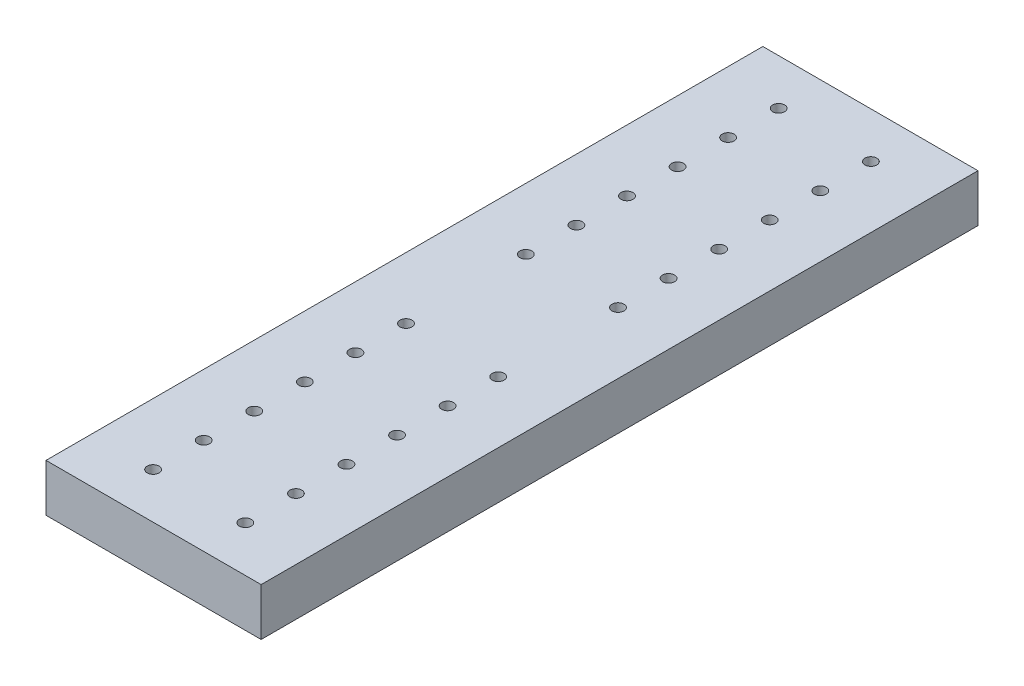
ISO-10303-21;
HEADER;
FILE_DESCRIPTION(('STEP AP214'),'2;1');
FILE_NAME('part.step','',(''),(''),'','','');
FILE_SCHEMA(('AUTOMOTIVE_DESIGN { 1 0 10303 214 1 1 1 1 }'));
ENDSEC;
DATA;
#1=APPLICATION_CONTEXT('core data for automotive mechanical design processes');
#2=APPLICATION_PROTOCOL_DEFINITION('international standard','automotive_design',2000,#1);
#3=PRODUCT_CONTEXT('',#1,'mechanical');
#4=PRODUCT('Part','Part','',(#3));
#5=PRODUCT_RELATED_PRODUCT_CATEGORY('part','',(#4));
#6=PRODUCT_DEFINITION_FORMATION('','',#4);
#7=PRODUCT_DEFINITION_CONTEXT('part definition',#1,'design');
#8=PRODUCT_DEFINITION('design','',#6,#7);
#9=PRODUCT_DEFINITION_SHAPE('','',#8);
#10=(LENGTH_UNIT() NAMED_UNIT(*) SI_UNIT(.MILLI.,.METRE.));
#11=(NAMED_UNIT(*) PLANE_ANGLE_UNIT() SI_UNIT($,.RADIAN.));
#12=(NAMED_UNIT(*) SI_UNIT($,.STERADIAN.) SOLID_ANGLE_UNIT());
#13=UNCERTAINTY_MEASURE_WITH_UNIT(LENGTH_MEASURE(1.E-05),#10,'distance_accuracy_value','');
#14=(GEOMETRIC_REPRESENTATION_CONTEXT(3) GLOBAL_UNCERTAINTY_ASSIGNED_CONTEXT((#13)) GLOBAL_UNIT_ASSIGNED_CONTEXT((#10,
#11,#12)) REPRESENTATION_CONTEXT('',''));
#15=CARTESIAN_POINT('',(0.,0.,0.));
#16=DIRECTION('',(0.,0.,1.));
#17=DIRECTION('',(1.,0.,0.));
#18=AXIS2_PLACEMENT_3D('',#15,#16,#17);
#19=CARTESIAN_POINT('',(-574.294,254.,1913.525));
#20=DIRECTION('',(1.,0.,0.));
#21=DIRECTION('',(0.,0.,-1.));
#22=AXIS2_PLACEMENT_3D('',#19,#20,#21);
#23=PLANE('',#22);
#24=DIRECTION('',(0.,0.,1.));
#25=VECTOR('',#24,1.);
#26=CARTESIAN_POINT('',(-574.294,0.,1913.525));
#27=LINE('',#26,#25);
#28=CARTESIAN_POINT('',(-574.294,0.,-1913.525));
#29=VERTEX_POINT('',#28);
#30=CARTESIAN_POINT('',(-574.294,0.,1913.525));
#31=VERTEX_POINT('',#30);
#32=EDGE_CURVE('E111',#29,#31,#27,.T.);
#33=ORIENTED_EDGE('',*,*,#32,.T.);
#34=DIRECTION('',(0.,-1.,0.));
#35=VECTOR('',#34,1.);
#36=CARTESIAN_POINT('',(-574.294,254.,1913.525));
#37=LINE('',#36,#35);
#38=CARTESIAN_POINT('',(-574.294,254.,1913.525));
#39=VERTEX_POINT('',#38);
#40=EDGE_CURVE('E11',#39,#31,#37,.T.);
#41=ORIENTED_EDGE('',*,*,#40,.F.);
#42=DIRECTION('',(0.,0.,1.));
#43=VECTOR('',#42,1.);
#44=CARTESIAN_POINT('',(-574.294,254.,1913.525));
#45=LINE('',#44,#43);
#46=CARTESIAN_POINT('',(-574.294,254.,-1913.525));
#47=VERTEX_POINT('',#46);
#48=EDGE_CURVE('E98',#47,#39,#45,.T.);
#49=ORIENTED_EDGE('',*,*,#48,.F.);
#50=DIRECTION('',(0.,-1.,0.));
#51=VECTOR('',#50,1.);
#52=CARTESIAN_POINT('',(-574.294,254.,-1913.525));
#53=LINE('',#52,#51);
#54=EDGE_CURVE('E109',#47,#29,#53,.T.);
#55=ORIENTED_EDGE('',*,*,#54,.T.);
#56=EDGE_LOOP('',(#33,#41,#49,#55));
#57=FACE_BOUND('',#56,.T.);
#58=ADVANCED_FACE('F46',(#57),#23,.F.);
#59=CARTESIAN_POINT('',(574.294,254.,1913.525));
#60=DIRECTION('',(0.,0.,-1.));
#61=DIRECTION('',(-1.,0.,0.));
#62=AXIS2_PLACEMENT_3D('',#59,#60,#61);
#63=PLANE('',#62);
#64=DIRECTION('',(1.,0.,0.));
#65=VECTOR('',#64,1.);
#66=CARTESIAN_POINT('',(574.294,0.,1913.525));
#67=LINE('',#66,#65);
#68=CARTESIAN_POINT('',(574.294,0.,1913.525));
#69=VERTEX_POINT('',#68);
#70=EDGE_CURVE('E103',#31,#69,#67,.T.);
#71=ORIENTED_EDGE('',*,*,#70,.T.);
#72=DIRECTION('',(0.,-1.,0.));
#73=VECTOR('',#72,1.);
#74=CARTESIAN_POINT('',(574.294,254.,1913.525));
#75=LINE('',#74,#73);
#76=CARTESIAN_POINT('',(574.294,254.,1913.525));
#77=VERTEX_POINT('',#76);
#78=EDGE_CURVE('E54',#77,#69,#75,.T.);
#79=ORIENTED_EDGE('',*,*,#78,.F.);
#80=DIRECTION('',(1.,0.,0.));
#81=VECTOR('',#80,1.);
#82=CARTESIAN_POINT('',(574.294,254.,1913.525));
#83=LINE('',#82,#81);
#84=EDGE_CURVE('E91',#39,#77,#83,.T.);
#85=ORIENTED_EDGE('',*,*,#84,.F.);
#86=ORIENTED_EDGE('',*,*,#40,.T.);
#87=EDGE_LOOP('',(#71,#79,#85,#86));
#88=FACE_BOUND('',#87,.T.);
#89=ADVANCED_FACE('F105',(#88),#63,.F.);
#90=CARTESIAN_POINT('',(574.294,254.,1913.525));
#91=DIRECTION('',(-1.,0.,0.));
#92=DIRECTION('',(0.,0.,1.));
#93=AXIS2_PLACEMENT_3D('',#90,#91,#92);
#94=PLANE('',#93);
#95=DIRECTION('',(0.,0.,-1.));
#96=VECTOR('',#95,1.);
#97=CARTESIAN_POINT('',(574.294,0.,1913.525));
#98=LINE('',#97,#96);
#99=CARTESIAN_POINT('',(574.294,0.,-1913.525));
#100=VERTEX_POINT('',#99);
#101=EDGE_CURVE('E78',#69,#100,#98,.T.);
#102=ORIENTED_EDGE('',*,*,#101,.T.);
#103=DIRECTION('',(0.,-1.,0.));
#104=VECTOR('',#103,1.);
#105=CARTESIAN_POINT('',(574.294,254.,-1913.525));
#106=LINE('',#105,#104);
#107=CARTESIAN_POINT('',(574.294,254.,-1913.525));
#108=VERTEX_POINT('',#107);
#109=EDGE_CURVE('E104',#108,#100,#106,.T.);
#110=ORIENTED_EDGE('',*,*,#109,.F.);
#111=DIRECTION('',(0.,0.,-1.));
#112=VECTOR('',#111,1.);
#113=CARTESIAN_POINT('',(574.294,254.,1913.525));
#114=LINE('',#113,#112);
#115=EDGE_CURVE('E96',#77,#108,#114,.T.);
#116=ORIENTED_EDGE('',*,*,#115,.F.);
#117=ORIENTED_EDGE('',*,*,#78,.T.);
#118=EDGE_LOOP('',(#102,#110,#116,#117));
#119=FACE_BOUND('',#118,.T.);
#120=ADVANCED_FACE('F106',(#119),#94,.F.);
#121=CARTESIAN_POINT('',(574.294,254.,-1913.525));
#122=DIRECTION('',(0.,0.,1.));
#123=DIRECTION('',(1.,0.,0.));
#124=AXIS2_PLACEMENT_3D('',#121,#122,#123);
#125=PLANE('',#124);
#126=DIRECTION('',(-1.,0.,0.));
#127=VECTOR('',#126,1.);
#128=CARTESIAN_POINT('',(574.294,0.,-1913.525));
#129=LINE('',#128,#127);
#130=EDGE_CURVE('E88',#100,#29,#129,.T.);
#131=ORIENTED_EDGE('',*,*,#130,.T.);
#132=ORIENTED_EDGE('',*,*,#54,.F.);
#133=DIRECTION('',(-1.,0.,0.));
#134=VECTOR('',#133,1.);
#135=CARTESIAN_POINT('',(574.294,254.,-1913.525));
#136=LINE('',#135,#134);
#137=EDGE_CURVE('E64',#108,#47,#136,.T.);
#138=ORIENTED_EDGE('',*,*,#137,.F.);
#139=ORIENTED_EDGE('',*,*,#109,.T.);
#140=EDGE_LOOP('',(#131,#132,#138,#139));
#141=FACE_BOUND('',#140,.T.);
#142=ADVANCED_FACE('F126',(#141),#125,.F.);
#143=CARTESIAN_POINT('',(0.,254.,0.));
#144=DIRECTION('',(0.,1.,0.));
#145=DIRECTION('',(0.,0.,1.));
#146=AXIS2_PLACEMENT_3D('',#143,#144,#145);
#147=PLANE('',#146);
#148=CARTESIAN_POINT('',(246.062499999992,254.,859.862500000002));
#149=DIRECTION('',(0.,1.,0.));
#150=DIRECTION('',(0.,0.,1.));
#151=AXIS2_PLACEMENT_3D('',#148,#149,#150);
#152=CIRCLE('',#151,31.75);
#153=CARTESIAN_POINT('',(246.062499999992,254.,891.612500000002));
#154=VERTEX_POINT('',#153);
#155=EDGE_CURVE('E224',#154,#154,#152,.T.);
#156=ORIENTED_EDGE('',*,*,#155,.F.);
#157=EDGE_LOOP('',(#156));
#158=FACE_BOUND('',#157,.T.);
#159=CARTESIAN_POINT('',(-246.062500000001,254.,-859.862500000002));
#160=DIRECTION('',(0.,1.,0.));
#161=DIRECTION('',(0.,0.,1.));
#162=AXIS2_PLACEMENT_3D('',#159,#160,#161);
#163=CIRCLE('',#162,31.7499999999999);
#164=CARTESIAN_POINT('',(-246.062500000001,254.,-828.112500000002));
#165=VERTEX_POINT('',#164);
#166=EDGE_CURVE('E235',#165,#165,#163,.T.);
#167=ORIENTED_EDGE('',*,*,#166,.F.);
#168=EDGE_LOOP('',(#167));
#169=FACE_BOUND('',#168,.T.);
#170=CARTESIAN_POINT('',(246.0625,254.,-859.862500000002));
#171=DIRECTION('',(0.,1.,0.));
#172=DIRECTION('',(0.,0.,1.));
#173=AXIS2_PLACEMENT_3D('',#170,#171,#172);
#174=CIRCLE('',#173,31.75);
#175=CARTESIAN_POINT('',(246.0625,254.,-828.112500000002));
#176=VERTEX_POINT('',#175);
#177=EDGE_CURVE('E210',#176,#176,#174,.T.);
#178=ORIENTED_EDGE('',*,*,#177,.F.);
#179=EDGE_LOOP('',(#178));
#180=FACE_BOUND('',#179,.T.);
#181=CARTESIAN_POINT('',(-246.062500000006,254.,1129.8625));
#182=DIRECTION('',(0.,1.,0.));
#183=DIRECTION('',(0.,0.,1.));
#184=AXIS2_PLACEMENT_3D('',#181,#182,#183);
#185=CIRCLE('',#184,31.7499999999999);
#186=CARTESIAN_POINT('',(-246.062500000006,254.,1161.6125));
#187=VERTEX_POINT('',#186);
#188=EDGE_CURVE('E216',#187,#187,#185,.T.);
#189=ORIENTED_EDGE('',*,*,#188,.F.);
#190=EDGE_LOOP('',(#189));
#191=FACE_BOUND('',#190,.T.);
#192=CARTESIAN_POINT('',(246.062499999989,254.,589.862500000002));
#193=DIRECTION('',(0.,1.,0.));
#194=DIRECTION('',(0.,0.,1.));
#195=AXIS2_PLACEMENT_3D('',#192,#193,#194);
#196=CIRCLE('',#195,31.75);
#197=CARTESIAN_POINT('',(246.062499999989,254.,621.612500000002));
#198=VERTEX_POINT('',#197);
#199=EDGE_CURVE('E254',#198,#198,#196,.T.);
#200=ORIENTED_EDGE('',*,*,#199,.F.);
#201=EDGE_LOOP('',(#200));
#202=FACE_BOUND('',#201,.T.);
#203=CARTESIAN_POINT('',(-246.062500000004,254.,-1129.8625));
#204=DIRECTION('',(0.,1.,0.));
#205=DIRECTION('',(0.,0.,1.));
#206=AXIS2_PLACEMENT_3D('',#203,#204,#205);
#207=CIRCLE('',#206,31.75);
#208=CARTESIAN_POINT('',(-246.062500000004,254.,-1098.1125));
#209=VERTEX_POINT('',#208);
#210=EDGE_CURVE('E262',#209,#209,#207,.T.);
#211=ORIENTED_EDGE('',*,*,#210,.F.);
#212=EDGE_LOOP('',(#211));
#213=FACE_BOUND('',#212,.T.);
#214=CARTESIAN_POINT('',(246.062499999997,254.,-1129.8625));
#215=DIRECTION('',(0.,1.,0.));
#216=DIRECTION('',(0.,0.,1.));
#217=AXIS2_PLACEMENT_3D('',#214,#215,#216);
#218=CIRCLE('',#217,31.75);
#219=CARTESIAN_POINT('',(246.062499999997,254.,-1098.1125));
#220=VERTEX_POINT('',#219);
#221=EDGE_CURVE('E239',#220,#220,#218,.T.);
#222=ORIENTED_EDGE('',*,*,#221,.F.);
#223=EDGE_LOOP('',(#222));
#224=FACE_BOUND('',#223,.T.);
#225=CARTESIAN_POINT('',(-246.062500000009,254.,859.862500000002));
#226=DIRECTION('',(0.,1.,0.));
#227=DIRECTION('',(0.,0.,1.));
#228=AXIS2_PLACEMENT_3D('',#225,#226,#227);
#229=CIRCLE('',#228,31.75);
#230=CARTESIAN_POINT('',(-246.062500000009,254.,891.612500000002));
#231=VERTEX_POINT('',#230);
#232=EDGE_CURVE('E247',#231,#231,#229,.T.);
#233=ORIENTED_EDGE('',*,*,#232,.F.);
#234=EDGE_LOOP('',(#233));
#235=FACE_BOUND('',#234,.T.);
#236=CARTESIAN_POINT('',(246.062499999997,254.,1399.8625));
#237=DIRECTION('',(0.,1.,0.));
#238=DIRECTION('',(0.,0.,1.));
#239=AXIS2_PLACEMENT_3D('',#236,#237,#238);
#240=CIRCLE('',#239,31.75);
#241=CARTESIAN_POINT('',(246.062499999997,254.,1431.6125));
#242=VERTEX_POINT('',#241);
#243=EDGE_CURVE('E157',#242,#242,#240,.T.);
#244=ORIENTED_EDGE('',*,*,#243,.F.);
#245=EDGE_LOOP('',(#244));
#246=FACE_BOUND('',#245,.T.);
#247=CARTESIAN_POINT('',(-246.062499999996,254.,-319.862500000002));
#248=DIRECTION('',(0.,1.,0.));
#249=DIRECTION('',(0.,0.,1.));
#250=AXIS2_PLACEMENT_3D('',#247,#248,#249);
#251=CIRCLE('',#250,31.75);
#252=CARTESIAN_POINT('',(-246.062499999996,254.,-288.112500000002));
#253=VERTEX_POINT('',#252);
#254=EDGE_CURVE('E169',#253,#253,#251,.T.);
#255=ORIENTED_EDGE('',*,*,#254,.F.);
#256=EDGE_LOOP('',(#255));
#257=FACE_BOUND('',#256,.T.);
#258=CARTESIAN_POINT('',(246.062500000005,254.,-319.862500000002));
#259=DIRECTION('',(0.,1.,0.));
#260=DIRECTION('',(0.,0.,1.));
#261=AXIS2_PLACEMENT_3D('',#258,#259,#260);
#262=CIRCLE('',#261,31.75);
#263=CARTESIAN_POINT('',(246.062500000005,254.,-288.112500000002));
#264=VERTEX_POINT('',#263);
#265=EDGE_CURVE('E141',#264,#264,#262,.T.);
#266=ORIENTED_EDGE('',*,*,#265,.F.);
#267=EDGE_LOOP('',(#266));
#268=FACE_BOUND('',#267,.T.);
#269=CARTESIAN_POINT('',(-246.0625,254.,1669.8625));
#270=DIRECTION('',(0.,1.,0.));
#271=DIRECTION('',(0.,0.,1.));
#272=AXIS2_PLACEMENT_3D('',#269,#270,#271);
#273=CIRCLE('',#272,31.75);
#274=CARTESIAN_POINT('',(-246.0625,254.,1701.6125));
#275=VERTEX_POINT('',#274);
#276=EDGE_CURVE('E155',#275,#275,#273,.T.);
#277=ORIENTED_EDGE('',*,*,#276,.F.);
#278=EDGE_LOOP('',(#277));
#279=FACE_BOUND('',#278,.T.);
#280=CARTESIAN_POINT('',(246.062499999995,254.,1129.8625));
#281=DIRECTION('',(0.,1.,0.));
#282=DIRECTION('',(0.,0.,1.));
#283=AXIS2_PLACEMENT_3D('',#280,#281,#282);
#284=CIRCLE('',#283,31.75);
#285=CARTESIAN_POINT('',(246.062499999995,254.,1161.6125));
#286=VERTEX_POINT('',#285);
#287=EDGE_CURVE('E191',#286,#286,#284,.T.);
#288=ORIENTED_EDGE('',*,*,#287,.F.);
#289=EDGE_LOOP('',(#288));
#290=FACE_BOUND('',#289,.T.);
#291=CARTESIAN_POINT('',(-246.062499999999,254.,-589.862500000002));
#292=DIRECTION('',(0.,1.,0.));
#293=DIRECTION('',(0.,0.,1.));
#294=AXIS2_PLACEMENT_3D('',#291,#292,#293);
#295=CIRCLE('',#294,31.75);
#296=CARTESIAN_POINT('',(-246.062499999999,254.,-558.112500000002));
#297=VERTEX_POINT('',#296);
#298=EDGE_CURVE('E199',#297,#297,#295,.T.);
#299=ORIENTED_EDGE('',*,*,#298,.F.);
#300=EDGE_LOOP('',(#299));
#301=FACE_BOUND('',#300,.T.);
#302=CARTESIAN_POINT('',(246.062500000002,254.,-589.862500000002));
#303=DIRECTION('',(0.,1.,0.));
#304=DIRECTION('',(0.,0.,1.));
#305=AXIS2_PLACEMENT_3D('',#302,#303,#304);
#306=CIRCLE('',#305,31.75);
#307=CARTESIAN_POINT('',(246.062500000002,254.,-558.112500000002));
#308=VERTEX_POINT('',#307);
#309=EDGE_CURVE('E173',#308,#308,#306,.T.);
#310=ORIENTED_EDGE('',*,*,#309,.F.);
#311=EDGE_LOOP('',(#310));
#312=FACE_BOUND('',#311,.T.);
#313=CARTESIAN_POINT('',(-246.062500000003,254.,1399.8625));
#314=DIRECTION('',(0.,1.,0.));
#315=DIRECTION('',(0.,0.,1.));
#316=AXIS2_PLACEMENT_3D('',#313,#314,#315);
#317=CIRCLE('',#316,31.75);
#318=CARTESIAN_POINT('',(-246.062500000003,254.,1431.6125));
#319=VERTEX_POINT('',#318);
#320=EDGE_CURVE('E184',#319,#319,#317,.T.);
#321=ORIENTED_EDGE('',*,*,#320,.F.);
#322=EDGE_LOOP('',(#321));
#323=FACE_BOUND('',#322,.T.);
#324=CARTESIAN_POINT('',(-246.062500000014,254.,319.862500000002));
#325=DIRECTION('',(0.,1.,0.));
#326=DIRECTION('',(0.,0.,1.));
#327=AXIS2_PLACEMENT_3D('',#324,#325,#326);
#328=CIRCLE('',#327,31.75);
#329=CARTESIAN_POINT('',(-246.062500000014,254.,351.612500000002));
#330=VERTEX_POINT('',#329);
#331=EDGE_CURVE('E315',#330,#330,#328,.T.);
#332=ORIENTED_EDGE('',*,*,#331,.F.);
#333=EDGE_LOOP('',(#332));
#334=FACE_BOUND('',#333,.T.);
#335=CARTESIAN_POINT('',(246.062499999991,254.,-1669.8625));
#336=DIRECTION('',(0.,1.,0.));
#337=DIRECTION('',(0.,0.,1.));
#338=AXIS2_PLACEMENT_3D('',#335,#336,#337);
#339=CIRCLE('',#338,31.75);
#340=CARTESIAN_POINT('',(246.062499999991,254.,-1638.1125));
#341=VERTEX_POINT('',#340);
#342=EDGE_CURVE('E302',#341,#341,#339,.T.);
#343=ORIENTED_EDGE('',*,*,#342,.F.);
#344=EDGE_LOOP('',(#343));
#345=FACE_BOUND('',#344,.T.);
#346=CARTESIAN_POINT('',(-246.06250000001,254.,-1669.8625));
#347=DIRECTION('',(0.,1.,0.));
#348=DIRECTION('',(0.,0.,1.));
#349=AXIS2_PLACEMENT_3D('',#346,#347,#348);
#350=CIRCLE('',#349,31.75);
#351=CARTESIAN_POINT('',(-246.06250000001,254.,-1638.1125));
#352=VERTEX_POINT('',#351);
#353=EDGE_CURVE('E317',#352,#352,#350,.T.);
#354=ORIENTED_EDGE('',*,*,#353,.F.);
#355=EDGE_LOOP('',(#354));
#356=FACE_BOUND('',#355,.T.);
#357=CARTESIAN_POINT('',(-246.062500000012,254.,589.862500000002));
#358=DIRECTION('',(0.,1.,0.));
#359=DIRECTION('',(0.,0.,1.));
#360=AXIS2_PLACEMENT_3D('',#357,#358,#359);
#361=CIRCLE('',#360,31.75);
#362=CARTESIAN_POINT('',(-246.062500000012,254.,621.612500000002));
#363=VERTEX_POINT('',#362);
#364=EDGE_CURVE('E278',#363,#363,#361,.T.);
#365=ORIENTED_EDGE('',*,*,#364,.F.);
#366=EDGE_LOOP('',(#365));
#367=FACE_BOUND('',#366,.T.);
#368=CARTESIAN_POINT('',(246.062499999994,254.,-1399.8625));
#369=DIRECTION('',(0.,1.,0.));
#370=DIRECTION('',(0.,0.,1.));
#371=AXIS2_PLACEMENT_3D('',#368,#369,#370);
#372=CIRCLE('',#371,31.75);
#373=CARTESIAN_POINT('',(246.062499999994,254.,-1368.1125));
#374=VERTEX_POINT('',#373);
#375=EDGE_CURVE('E271',#374,#374,#372,.T.);
#376=ORIENTED_EDGE('',*,*,#375,.F.);
#377=EDGE_LOOP('',(#376));
#378=FACE_BOUND('',#377,.T.);
#379=CARTESIAN_POINT('',(-246.062500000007,254.,-1399.8625));
#380=DIRECTION('',(0.,1.,0.));
#381=DIRECTION('',(0.,0.,1.));
#382=AXIS2_PLACEMENT_3D('',#379,#380,#381);
#383=CIRCLE('',#382,31.75);
#384=CARTESIAN_POINT('',(-246.062500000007,254.,-1368.1125));
#385=VERTEX_POINT('',#384);
#386=EDGE_CURVE('E297',#385,#385,#383,.T.);
#387=ORIENTED_EDGE('',*,*,#386,.F.);
#388=EDGE_LOOP('',(#387));
#389=FACE_BOUND('',#388,.T.);
#390=CARTESIAN_POINT('',(246.062499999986,254.,319.862500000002));
#391=DIRECTION('',(0.,1.,0.));
#392=DIRECTION('',(0.,0.,1.));
#393=AXIS2_PLACEMENT_3D('',#390,#391,#392);
#394=CIRCLE('',#393,31.75);
#395=CARTESIAN_POINT('',(246.062499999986,254.,351.612500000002));
#396=VERTEX_POINT('',#395);
#397=EDGE_CURVE('E290',#396,#396,#394,.T.);
#398=ORIENTED_EDGE('',*,*,#397,.F.);
#399=EDGE_LOOP('',(#398));
#400=FACE_BOUND('',#399,.T.);
#401=CARTESIAN_POINT('',(246.0625,254.,1669.8625));
#402=DIRECTION('',(0.,1.,0.));
#403=DIRECTION('',(0.,0.,1.));
#404=AXIS2_PLACEMENT_3D('',#401,#402,#403);
#405=CIRCLE('',#404,31.75);
#406=CARTESIAN_POINT('',(246.0625,254.,1701.6125));
#407=VERTEX_POINT('',#406);
#408=EDGE_CURVE('E119',#407,#407,#405,.T.);
#409=ORIENTED_EDGE('',*,*,#408,.F.);
#410=EDGE_LOOP('',(#409));
#411=FACE_BOUND('',#410,.T.);
#412=ORIENTED_EDGE('',*,*,#48,.T.);
#413=ORIENTED_EDGE('',*,*,#84,.T.);
#414=ORIENTED_EDGE('',*,*,#115,.T.);
#415=ORIENTED_EDGE('',*,*,#137,.T.);
#416=EDGE_LOOP('',(#412,#413,#414,#415));
#417=FACE_BOUND('',#416,.T.);
#418=ADVANCED_FACE('F94',(#158,#169,#180,#191,#202,#213,#224,#235,#246,#257,#268,#279,#290,#301,
#312,#323,#334,#345,#356,#367,#378,#389,#400,#411,#417),#147,.T.);
#419=CARTESIAN_POINT('',(0.,0.,0.));
#420=DIRECTION('',(0.,1.,0.));
#421=DIRECTION('',(0.,0.,1.));
#422=AXIS2_PLACEMENT_3D('',#419,#420,#421);
#423=PLANE('',#422);
#424=CARTESIAN_POINT('',(246.062499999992,0.,859.862500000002));
#425=DIRECTION('',(0.,1.,0.));
#426=DIRECTION('',(0.,0.,1.));
#427=AXIS2_PLACEMENT_3D('',#424,#425,#426);
#428=CIRCLE('',#427,31.75);
#429=CARTESIAN_POINT('',(246.062499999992,0.,891.612500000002));
#430=VERTEX_POINT('',#429);
#431=EDGE_CURVE('E230',#430,#430,#428,.T.);
#432=ORIENTED_EDGE('',*,*,#431,.T.);
#433=EDGE_LOOP('',(#432));
#434=FACE_BOUND('',#433,.T.);
#435=CARTESIAN_POINT('',(-246.062500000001,0.,-859.862500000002));
#436=DIRECTION('',(0.,1.,0.));
#437=DIRECTION('',(0.,0.,1.));
#438=AXIS2_PLACEMENT_3D('',#435,#436,#437);
#439=CIRCLE('',#438,31.7499999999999);
#440=CARTESIAN_POINT('',(-246.062500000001,0.,-828.112500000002));
#441=VERTEX_POINT('',#440);
#442=EDGE_CURVE('E215',#441,#441,#439,.T.);
#443=ORIENTED_EDGE('',*,*,#442,.T.);
#444=EDGE_LOOP('',(#443));
#445=FACE_BOUND('',#444,.T.);
#446=CARTESIAN_POINT('',(246.0625,0.,-859.862500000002));
#447=DIRECTION('',(0.,1.,0.));
#448=DIRECTION('',(0.,0.,1.));
#449=AXIS2_PLACEMENT_3D('',#446,#447,#448);
#450=CIRCLE('',#449,31.75);
#451=CARTESIAN_POINT('',(246.0625,0.,-828.112500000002));
#452=VERTEX_POINT('',#451);
#453=EDGE_CURVE('E211',#452,#452,#450,.T.);
#454=ORIENTED_EDGE('',*,*,#453,.T.);
#455=EDGE_LOOP('',(#454));
#456=FACE_BOUND('',#455,.T.);
#457=CARTESIAN_POINT('',(-246.062500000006,0.,1129.8625));
#458=DIRECTION('',(0.,1.,0.));
#459=DIRECTION('',(0.,0.,1.));
#460=AXIS2_PLACEMENT_3D('',#457,#458,#459);
#461=CIRCLE('',#460,31.7499999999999);
#462=CARTESIAN_POINT('',(-246.062500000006,0.,1161.6125));
#463=VERTEX_POINT('',#462);
#464=EDGE_CURVE('E198',#463,#463,#461,.T.);
#465=ORIENTED_EDGE('',*,*,#464,.T.);
#466=EDGE_LOOP('',(#465));
#467=FACE_BOUND('',#466,.T.);
#468=CARTESIAN_POINT('',(246.062499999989,0.,589.862500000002));
#469=DIRECTION('',(0.,1.,0.));
#470=DIRECTION('',(0.,0.,1.));
#471=AXIS2_PLACEMENT_3D('',#468,#469,#470);
#472=CIRCLE('',#471,31.75);
#473=CARTESIAN_POINT('',(246.062499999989,0.,621.612500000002));
#474=VERTEX_POINT('',#473);
#475=EDGE_CURVE('E259',#474,#474,#472,.T.);
#476=ORIENTED_EDGE('',*,*,#475,.T.);
#477=EDGE_LOOP('',(#476));
#478=FACE_BOUND('',#477,.T.);
#479=CARTESIAN_POINT('',(-246.062500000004,0.,-1129.8625));
#480=DIRECTION('',(0.,1.,0.));
#481=DIRECTION('',(0.,0.,1.));
#482=AXIS2_PLACEMENT_3D('',#479,#480,#481);
#483=CIRCLE('',#482,31.75);
#484=CARTESIAN_POINT('',(-246.062500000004,0.,-1098.1125));
#485=VERTEX_POINT('',#484);
#486=EDGE_CURVE('E241',#485,#485,#483,.T.);
#487=ORIENTED_EDGE('',*,*,#486,.T.);
#488=EDGE_LOOP('',(#487));
#489=FACE_BOUND('',#488,.T.);
#490=CARTESIAN_POINT('',(246.062499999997,0.,-1129.8625));
#491=DIRECTION('',(0.,1.,0.));
#492=DIRECTION('',(0.,0.,1.));
#493=AXIS2_PLACEMENT_3D('',#490,#491,#492);
#494=CIRCLE('',#493,31.75);
#495=CARTESIAN_POINT('',(246.062499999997,0.,-1098.1125));
#496=VERTEX_POINT('',#495);
#497=EDGE_CURVE('E244',#496,#496,#494,.T.);
#498=ORIENTED_EDGE('',*,*,#497,.T.);
#499=EDGE_LOOP('',(#498));
#500=FACE_BOUND('',#499,.T.);
#501=CARTESIAN_POINT('',(-246.062500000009,0.,859.862500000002));
#502=DIRECTION('',(0.,1.,0.));
#503=DIRECTION('',(0.,0.,1.));
#504=AXIS2_PLACEMENT_3D('',#501,#502,#503);
#505=CIRCLE('',#504,31.75);
#506=CARTESIAN_POINT('',(-246.062500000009,0.,891.612500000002));
#507=VERTEX_POINT('',#506);
#508=EDGE_CURVE('E229',#507,#507,#505,.T.);
#509=ORIENTED_EDGE('',*,*,#508,.T.);
#510=EDGE_LOOP('',(#509));
#511=FACE_BOUND('',#510,.T.);
#512=CARTESIAN_POINT('',(246.062499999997,0.,1399.8625));
#513=DIRECTION('',(0.,1.,0.));
#514=DIRECTION('',(0.,0.,1.));
#515=AXIS2_PLACEMENT_3D('',#512,#513,#514);
#516=CIRCLE('',#515,31.75);
#517=CARTESIAN_POINT('',(246.062499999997,0.,1431.6125));
#518=VERTEX_POINT('',#517);
#519=EDGE_CURVE('E162',#518,#518,#516,.T.);
#520=ORIENTED_EDGE('',*,*,#519,.T.);
#521=EDGE_LOOP('',(#520));
#522=FACE_BOUND('',#521,.T.);
#523=CARTESIAN_POINT('',(-246.062499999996,0.,-319.862500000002));
#524=DIRECTION('',(0.,1.,0.));
#525=DIRECTION('',(0.,0.,1.));
#526=AXIS2_PLACEMENT_3D('',#523,#524,#525);
#527=CIRCLE('',#526,31.75);
#528=CARTESIAN_POINT('',(-246.062499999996,0.,-288.112500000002));
#529=VERTEX_POINT('',#528);
#530=EDGE_CURVE('E146',#529,#529,#527,.T.);
#531=ORIENTED_EDGE('',*,*,#530,.T.);
#532=EDGE_LOOP('',(#531));
#533=FACE_BOUND('',#532,.T.);
#534=CARTESIAN_POINT('',(246.062500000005,0.,-319.862500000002));
#535=DIRECTION('',(0.,1.,0.));
#536=DIRECTION('',(0.,0.,1.));
#537=AXIS2_PLACEMENT_3D('',#534,#535,#536);
#538=CIRCLE('',#537,31.75);
#539=CARTESIAN_POINT('',(246.062500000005,0.,-288.112500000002));
#540=VERTEX_POINT('',#539);
#541=EDGE_CURVE('E150',#540,#540,#538,.T.);
#542=ORIENTED_EDGE('',*,*,#541,.T.);
#543=EDGE_LOOP('',(#542));
#544=FACE_BOUND('',#543,.T.);
#545=CARTESIAN_POINT('',(-246.0625,0.,1669.8625));
#546=DIRECTION('',(0.,1.,0.));
#547=DIRECTION('',(0.,0.,1.));
#548=AXIS2_PLACEMENT_3D('',#545,#546,#547);
#549=CIRCLE('',#548,31.75);
#550=CARTESIAN_POINT('',(-246.0625,0.,1701.6125));
#551=VERTEX_POINT('',#550);
#552=EDGE_CURVE('E138',#551,#551,#549,.T.);
#553=ORIENTED_EDGE('',*,*,#552,.T.);
#554=EDGE_LOOP('',(#553));
#555=FACE_BOUND('',#554,.T.);
#556=CARTESIAN_POINT('',(246.062499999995,0.,1129.8625));
#557=DIRECTION('',(0.,1.,0.));
#558=DIRECTION('',(0.,0.,1.));
#559=AXIS2_PLACEMENT_3D('',#556,#557,#558);
#560=CIRCLE('',#559,31.75);
#561=CARTESIAN_POINT('',(246.062499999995,0.,1161.6125));
#562=VERTEX_POINT('',#561);
#563=EDGE_CURVE('E194',#562,#562,#560,.T.);
#564=ORIENTED_EDGE('',*,*,#563,.T.);
#565=EDGE_LOOP('',(#564));
#566=FACE_BOUND('',#565,.T.);
#567=CARTESIAN_POINT('',(-246.062499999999,0.,-589.862500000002));
#568=DIRECTION('',(0.,1.,0.));
#569=DIRECTION('',(0.,0.,1.));
#570=AXIS2_PLACEMENT_3D('',#567,#568,#569);
#571=CIRCLE('',#570,31.75);
#572=CARTESIAN_POINT('',(-246.062499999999,0.,-558.112500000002));
#573=VERTEX_POINT('',#572);
#574=EDGE_CURVE('E179',#573,#573,#571,.T.);
#575=ORIENTED_EDGE('',*,*,#574,.T.);
#576=EDGE_LOOP('',(#575));
#577=FACE_BOUND('',#576,.T.);
#578=CARTESIAN_POINT('',(246.062500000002,0.,-589.862500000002));
#579=DIRECTION('',(0.,1.,0.));
#580=DIRECTION('',(0.,0.,1.));
#581=AXIS2_PLACEMENT_3D('',#578,#579,#580);
#582=CIRCLE('',#581,31.75);
#583=CARTESIAN_POINT('',(246.062500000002,0.,-558.112500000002));
#584=VERTEX_POINT('',#583);
#585=EDGE_CURVE('E178',#584,#584,#582,.T.);
#586=ORIENTED_EDGE('',*,*,#585,.T.);
#587=EDGE_LOOP('',(#586));
#588=FACE_BOUND('',#587,.T.);
#589=CARTESIAN_POINT('',(-246.062500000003,0.,1399.8625));
#590=DIRECTION('',(0.,1.,0.));
#591=DIRECTION('',(0.,0.,1.));
#592=AXIS2_PLACEMENT_3D('',#589,#590,#591);
#593=CIRCLE('',#592,31.75);
#594=CARTESIAN_POINT('',(-246.062500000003,0.,1431.6125));
#595=VERTEX_POINT('',#594);
#596=EDGE_CURVE('E163',#595,#595,#593,.T.);
#597=ORIENTED_EDGE('',*,*,#596,.T.);
#598=EDGE_LOOP('',(#597));
#599=FACE_BOUND('',#598,.T.);
#600=CARTESIAN_POINT('',(-246.062500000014,0.,319.862500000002));
#601=DIRECTION('',(0.,1.,0.));
#602=DIRECTION('',(0.,0.,1.));
#603=AXIS2_PLACEMENT_3D('',#600,#601,#602);
#604=CIRCLE('',#603,31.75);
#605=CARTESIAN_POINT('',(-246.062500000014,0.,351.612500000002));
#606=VERTEX_POINT('',#605);
#607=EDGE_CURVE('E295',#606,#606,#604,.T.);
#608=ORIENTED_EDGE('',*,*,#607,.T.);
#609=EDGE_LOOP('',(#608));
#610=FACE_BOUND('',#609,.T.);
#611=CARTESIAN_POINT('',(246.062499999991,0.,-1669.8625));
#612=DIRECTION('',(0.,1.,0.));
#613=DIRECTION('',(0.,0.,1.));
#614=AXIS2_PLACEMENT_3D('',#611,#612,#613);
#615=CIRCLE('',#614,31.75);
#616=CARTESIAN_POINT('',(246.062499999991,0.,-1638.1125));
#617=VERTEX_POINT('',#616);
#618=EDGE_CURVE('E307',#617,#617,#615,.T.);
#619=ORIENTED_EDGE('',*,*,#618,.T.);
#620=EDGE_LOOP('',(#619));
#621=FACE_BOUND('',#620,.T.);
#622=CARTESIAN_POINT('',(-246.06250000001,0.,-1669.8625));
#623=DIRECTION('',(0.,1.,0.));
#624=DIRECTION('',(0.,0.,1.));
#625=AXIS2_PLACEMENT_3D('',#622,#623,#624);
#626=CIRCLE('',#625,31.75);
#627=CARTESIAN_POINT('',(-246.06250000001,0.,-1638.1125));
#628=VERTEX_POINT('',#627);
#629=EDGE_CURVE('E306',#628,#628,#626,.T.);
#630=ORIENTED_EDGE('',*,*,#629,.T.);
#631=EDGE_LOOP('',(#630));
#632=FACE_BOUND('',#631,.T.);
#633=CARTESIAN_POINT('',(-246.062500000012,0.,589.862500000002));
#634=DIRECTION('',(0.,1.,0.));
#635=DIRECTION('',(0.,0.,1.));
#636=AXIS2_PLACEMENT_3D('',#633,#634,#635);
#637=CIRCLE('',#636,31.75);
#638=CARTESIAN_POINT('',(-246.062500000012,0.,621.612500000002));
#639=VERTEX_POINT('',#638);
#640=EDGE_CURVE('E257',#639,#639,#637,.T.);
#641=ORIENTED_EDGE('',*,*,#640,.T.);
#642=EDGE_LOOP('',(#641));
#643=FACE_BOUND('',#642,.T.);
#644=CARTESIAN_POINT('',(246.062499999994,0.,-1399.8625));
#645=DIRECTION('',(0.,1.,0.));
#646=DIRECTION('',(0.,0.,1.));
#647=AXIS2_PLACEMENT_3D('',#644,#645,#646);
#648=CIRCLE('',#647,31.75);
#649=CARTESIAN_POINT('',(246.062499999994,0.,-1368.1125));
#650=VERTEX_POINT('',#649);
#651=EDGE_CURVE('E274',#650,#650,#648,.T.);
#652=ORIENTED_EDGE('',*,*,#651,.T.);
#653=EDGE_LOOP('',(#652));
#654=FACE_BOUND('',#653,.T.);
#655=CARTESIAN_POINT('',(-246.062500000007,0.,-1399.8625));
#656=DIRECTION('',(0.,1.,0.));
#657=DIRECTION('',(0.,0.,1.));
#658=AXIS2_PLACEMENT_3D('',#655,#656,#657);
#659=CIRCLE('',#658,31.75);
#660=CARTESIAN_POINT('',(-246.062500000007,0.,-1368.1125));
#661=VERTEX_POINT('',#660);
#662=EDGE_CURVE('E277',#661,#661,#659,.T.);
#663=ORIENTED_EDGE('',*,*,#662,.T.);
#664=EDGE_LOOP('',(#663));
#665=FACE_BOUND('',#664,.T.);
#666=CARTESIAN_POINT('',(246.062499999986,0.,319.862500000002));
#667=DIRECTION('',(0.,1.,0.));
#668=DIRECTION('',(0.,0.,1.));
#669=AXIS2_PLACEMENT_3D('',#666,#667,#668);
#670=CIRCLE('',#669,31.75);
#671=CARTESIAN_POINT('',(246.062499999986,0.,351.612500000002));
#672=VERTEX_POINT('',#671);
#673=EDGE_CURVE('E292',#672,#672,#670,.T.);
#674=ORIENTED_EDGE('',*,*,#673,.T.);
#675=EDGE_LOOP('',(#674));
#676=FACE_BOUND('',#675,.T.);
#677=CARTESIAN_POINT('',(246.0625,0.,1669.8625));
#678=DIRECTION('',(0.,1.,0.));
#679=DIRECTION('',(0.,0.,1.));
#680=AXIS2_PLACEMENT_3D('',#677,#678,#679);
#681=CIRCLE('',#680,31.75);
#682=CARTESIAN_POINT('',(246.0625,0.,1701.6125));
#683=VERTEX_POINT('',#682);
#684=EDGE_CURVE('E133',#683,#683,#681,.T.);
#685=ORIENTED_EDGE('',*,*,#684,.T.);
#686=EDGE_LOOP('',(#685));
#687=FACE_BOUND('',#686,.T.);
#688=ORIENTED_EDGE('',*,*,#32,.F.);
#689=ORIENTED_EDGE('',*,*,#130,.F.);
#690=ORIENTED_EDGE('',*,*,#101,.F.);
#691=ORIENTED_EDGE('',*,*,#70,.F.);
#692=EDGE_LOOP('',(#688,#689,#690,#691));
#693=FACE_BOUND('',#692,.T.);
#694=ADVANCED_FACE('F132',(#434,#445,#456,#467,#478,#489,#500,#511,#522,#533,#544,#555,#566,
#577,#588,#599,#610,#621,#632,#643,#654,#665,#676,#687,#693),#423,.F.);
#695=CARTESIAN_POINT('',(246.0625,254.,1669.8625));
#696=DIRECTION('',(0.,-1.,0.));
#697=DIRECTION('',(0.,0.,-1.));
#698=AXIS2_PLACEMENT_3D('',#695,#696,#697);
#699=CYLINDRICAL_SURFACE('',#698,31.75);
#700=ORIENTED_EDGE('',*,*,#408,.T.);
#701=EDGE_LOOP('',(#700));
#702=FACE_BOUND('',#701,.T.);
#703=ORIENTED_EDGE('',*,*,#684,.F.);
#704=EDGE_LOOP('',(#703));
#705=FACE_BOUND('',#704,.T.);
#706=ADVANCED_FACE('F358',(#702,#705),#699,.F.);
#707=CARTESIAN_POINT('',(246.062499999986,254.,319.862500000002));
#708=DIRECTION('',(0.,-1.,0.));
#709=DIRECTION('',(0.,0.,-1.));
#710=AXIS2_PLACEMENT_3D('',#707,#708,#709);
#711=CYLINDRICAL_SURFACE('',#710,31.75);
#712=ORIENTED_EDGE('',*,*,#397,.T.);
#713=EDGE_LOOP('',(#712));
#714=FACE_BOUND('',#713,.T.);
#715=ORIENTED_EDGE('',*,*,#673,.F.);
#716=EDGE_LOOP('',(#715));
#717=FACE_BOUND('',#716,.T.);
#718=ADVANCED_FACE('F368',(#714,#717),#711,.F.);
#719=CARTESIAN_POINT('',(-246.062500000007,254.,-1399.8625));
#720=DIRECTION('',(0.,-1.,0.));
#721=DIRECTION('',(0.,0.,-1.));
#722=AXIS2_PLACEMENT_3D('',#719,#720,#721);
#723=CYLINDRICAL_SURFACE('',#722,31.75);
#724=ORIENTED_EDGE('',*,*,#386,.T.);
#725=EDGE_LOOP('',(#724));
#726=FACE_BOUND('',#725,.T.);
#727=ORIENTED_EDGE('',*,*,#662,.F.);
#728=EDGE_LOOP('',(#727));
#729=FACE_BOUND('',#728,.T.);
#730=ADVANCED_FACE('F433',(#726,#729),#723,.F.);
#731=CARTESIAN_POINT('',(246.062499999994,254.,-1399.8625));
#732=DIRECTION('',(0.,-1.,0.));
#733=DIRECTION('',(0.,0.,-1.));
#734=AXIS2_PLACEMENT_3D('',#731,#732,#733);
#735=CYLINDRICAL_SURFACE('',#734,31.75);
#736=ORIENTED_EDGE('',*,*,#375,.T.);
#737=EDGE_LOOP('',(#736));
#738=FACE_BOUND('',#737,.T.);
#739=ORIENTED_EDGE('',*,*,#651,.F.);
#740=EDGE_LOOP('',(#739));
#741=FACE_BOUND('',#740,.T.);
#742=ADVANCED_FACE('F345',(#738,#741),#735,.F.);
#743=CARTESIAN_POINT('',(-246.062500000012,254.,589.862500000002));
#744=DIRECTION('',(0.,-1.,0.));
#745=DIRECTION('',(0.,0.,-1.));
#746=AXIS2_PLACEMENT_3D('',#743,#744,#745);
#747=CYLINDRICAL_SURFACE('',#746,31.75);
#748=ORIENTED_EDGE('',*,*,#364,.T.);
#749=EDGE_LOOP('',(#748));
#750=FACE_BOUND('',#749,.T.);
#751=ORIENTED_EDGE('',*,*,#640,.F.);
#752=EDGE_LOOP('',(#751));
#753=FACE_BOUND('',#752,.T.);
#754=ADVANCED_FACE('F335',(#750,#753),#747,.F.);
#755=CARTESIAN_POINT('',(-246.06250000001,254.,-1669.8625));
#756=DIRECTION('',(0.,-1.,0.));
#757=DIRECTION('',(0.,0.,-1.));
#758=AXIS2_PLACEMENT_3D('',#755,#756,#757);
#759=CYLINDRICAL_SURFACE('',#758,31.75);
#760=ORIENTED_EDGE('',*,*,#353,.T.);
#761=EDGE_LOOP('',(#760));
#762=FACE_BOUND('',#761,.T.);
#763=ORIENTED_EDGE('',*,*,#629,.F.);
#764=EDGE_LOOP('',(#763));
#765=FACE_BOUND('',#764,.T.);
#766=ADVANCED_FACE('F328',(#762,#765),#759,.F.);
#767=CARTESIAN_POINT('',(246.062499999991,254.,-1669.8625));
#768=DIRECTION('',(0.,-1.,0.));
#769=DIRECTION('',(0.,0.,-1.));
#770=AXIS2_PLACEMENT_3D('',#767,#768,#769);
#771=CYLINDRICAL_SURFACE('',#770,31.75);
#772=ORIENTED_EDGE('',*,*,#342,.T.);
#773=EDGE_LOOP('',(#772));
#774=FACE_BOUND('',#773,.T.);
#775=ORIENTED_EDGE('',*,*,#618,.F.);
#776=EDGE_LOOP('',(#775));
#777=FACE_BOUND('',#776,.T.);
#778=ADVANCED_FACE('F332',(#774,#777),#771,.F.);
#779=CARTESIAN_POINT('',(-246.062500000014,254.,319.862500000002));
#780=DIRECTION('',(0.,-1.,0.));
#781=DIRECTION('',(0.,0.,-1.));
#782=AXIS2_PLACEMENT_3D('',#779,#780,#781);
#783=CYLINDRICAL_SURFACE('',#782,31.75);
#784=ORIENTED_EDGE('',*,*,#331,.T.);
#785=EDGE_LOOP('',(#784));
#786=FACE_BOUND('',#785,.T.);
#787=ORIENTED_EDGE('',*,*,#607,.F.);
#788=EDGE_LOOP('',(#787));
#789=FACE_BOUND('',#788,.T.);
#790=ADVANCED_FACE('F336',(#786,#789),#783,.F.);
#791=CARTESIAN_POINT('',(-246.062500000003,254.,1399.8625));
#792=DIRECTION('',(0.,-1.,0.));
#793=DIRECTION('',(0.,0.,-1.));
#794=AXIS2_PLACEMENT_3D('',#791,#792,#793);
#795=CYLINDRICAL_SURFACE('',#794,31.75);
#796=ORIENTED_EDGE('',*,*,#320,.T.);
#797=EDGE_LOOP('',(#796));
#798=FACE_BOUND('',#797,.T.);
#799=ORIENTED_EDGE('',*,*,#596,.F.);
#800=EDGE_LOOP('',(#799));
#801=FACE_BOUND('',#800,.T.);
#802=ADVANCED_FACE('F388',(#798,#801),#795,.F.);
#803=CARTESIAN_POINT('',(246.062500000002,254.,-589.862500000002));
#804=DIRECTION('',(0.,-1.,0.));
#805=DIRECTION('',(0.,0.,-1.));
#806=AXIS2_PLACEMENT_3D('',#803,#804,#805);
#807=CYLINDRICAL_SURFACE('',#806,31.75);
#808=ORIENTED_EDGE('',*,*,#309,.T.);
#809=EDGE_LOOP('',(#808));
#810=FACE_BOUND('',#809,.T.);
#811=ORIENTED_EDGE('',*,*,#585,.F.);
#812=EDGE_LOOP('',(#811));
#813=FACE_BOUND('',#812,.T.);
#814=ADVANCED_FACE('F387',(#810,#813),#807,.F.);
#815=CARTESIAN_POINT('',(-246.062499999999,254.,-589.862500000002));
#816=DIRECTION('',(0.,-1.,0.));
#817=DIRECTION('',(0.,0.,-1.));
#818=AXIS2_PLACEMENT_3D('',#815,#816,#817);
#819=CYLINDRICAL_SURFACE('',#818,31.75);
#820=ORIENTED_EDGE('',*,*,#298,.T.);
#821=EDGE_LOOP('',(#820));
#822=FACE_BOUND('',#821,.T.);
#823=ORIENTED_EDGE('',*,*,#574,.F.);
#824=EDGE_LOOP('',(#823));
#825=FACE_BOUND('',#824,.T.);
#826=ADVANCED_FACE('F386',(#822,#825),#819,.F.);
#827=CARTESIAN_POINT('',(246.062499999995,254.,1129.8625));
#828=DIRECTION('',(0.,-1.,0.));
#829=DIRECTION('',(0.,0.,-1.));
#830=AXIS2_PLACEMENT_3D('',#827,#828,#829);
#831=CYLINDRICAL_SURFACE('',#830,31.75);
#832=ORIENTED_EDGE('',*,*,#287,.T.);
#833=EDGE_LOOP('',(#832));
#834=FACE_BOUND('',#833,.T.);
#835=ORIENTED_EDGE('',*,*,#563,.F.);
#836=EDGE_LOOP('',(#835));
#837=FACE_BOUND('',#836,.T.);
#838=ADVANCED_FACE('F376',(#834,#837),#831,.F.);
#839=CARTESIAN_POINT('',(-246.0625,254.,1669.8625));
#840=DIRECTION('',(0.,-1.,0.));
#841=DIRECTION('',(0.,0.,-1.));
#842=AXIS2_PLACEMENT_3D('',#839,#840,#841);
#843=CYLINDRICAL_SURFACE('',#842,31.75);
#844=ORIENTED_EDGE('',*,*,#276,.T.);
#845=EDGE_LOOP('',(#844));
#846=FACE_BOUND('',#845,.T.);
#847=ORIENTED_EDGE('',*,*,#552,.F.);
#848=EDGE_LOOP('',(#847));
#849=FACE_BOUND('',#848,.T.);
#850=ADVANCED_FACE('F375',(#846,#849),#843,.F.);
#851=CARTESIAN_POINT('',(246.062500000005,254.,-319.862500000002));
#852=DIRECTION('',(0.,-1.,0.));
#853=DIRECTION('',(0.,0.,-1.));
#854=AXIS2_PLACEMENT_3D('',#851,#852,#853);
#855=CYLINDRICAL_SURFACE('',#854,31.75);
#856=ORIENTED_EDGE('',*,*,#265,.T.);
#857=EDGE_LOOP('',(#856));
#858=FACE_BOUND('',#857,.T.);
#859=ORIENTED_EDGE('',*,*,#541,.F.);
#860=EDGE_LOOP('',(#859));
#861=FACE_BOUND('',#860,.T.);
#862=ADVANCED_FACE('F366',(#858,#861),#855,.F.);
#863=CARTESIAN_POINT('',(-246.062499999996,254.,-319.862500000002));
#864=DIRECTION('',(0.,-1.,0.));
#865=DIRECTION('',(0.,0.,-1.));
#866=AXIS2_PLACEMENT_3D('',#863,#864,#865);
#867=CYLINDRICAL_SURFACE('',#866,31.75);
#868=ORIENTED_EDGE('',*,*,#254,.T.);
#869=EDGE_LOOP('',(#868));
#870=FACE_BOUND('',#869,.T.);
#871=ORIENTED_EDGE('',*,*,#530,.F.);
#872=EDGE_LOOP('',(#871));
#873=FACE_BOUND('',#872,.T.);
#874=ADVANCED_FACE('F371',(#870,#873),#867,.F.);
#875=CARTESIAN_POINT('',(246.062499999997,254.,1399.8625));
#876=DIRECTION('',(0.,-1.,0.));
#877=DIRECTION('',(0.,0.,-1.));
#878=AXIS2_PLACEMENT_3D('',#875,#876,#877);
#879=CYLINDRICAL_SURFACE('',#878,31.75);
#880=ORIENTED_EDGE('',*,*,#243,.T.);
#881=EDGE_LOOP('',(#880));
#882=FACE_BOUND('',#881,.T.);
#883=ORIENTED_EDGE('',*,*,#519,.F.);
#884=EDGE_LOOP('',(#883));
#885=FACE_BOUND('',#884,.T.);
#886=ADVANCED_FACE('F378',(#882,#885),#879,.F.);
#887=CARTESIAN_POINT('',(-246.062500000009,254.,859.862500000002));
#888=DIRECTION('',(0.,-1.,0.));
#889=DIRECTION('',(0.,0.,-1.));
#890=AXIS2_PLACEMENT_3D('',#887,#888,#889);
#891=CYLINDRICAL_SURFACE('',#890,31.75);
#892=ORIENTED_EDGE('',*,*,#232,.T.);
#893=EDGE_LOOP('',(#892));
#894=FACE_BOUND('',#893,.T.);
#895=ORIENTED_EDGE('',*,*,#508,.F.);
#896=EDGE_LOOP('',(#895));
#897=FACE_BOUND('',#896,.T.);
#898=ADVANCED_FACE('F381',(#894,#897),#891,.F.);
#899=CARTESIAN_POINT('',(246.062499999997,254.,-1129.8625));
#900=DIRECTION('',(0.,-1.,0.));
#901=DIRECTION('',(0.,0.,-1.));
#902=AXIS2_PLACEMENT_3D('',#899,#900,#901);
#903=CYLINDRICAL_SURFACE('',#902,31.75);
#904=ORIENTED_EDGE('',*,*,#221,.T.);
#905=EDGE_LOOP('',(#904));
#906=FACE_BOUND('',#905,.T.);
#907=ORIENTED_EDGE('',*,*,#497,.F.);
#908=EDGE_LOOP('',(#907));
#909=FACE_BOUND('',#908,.T.);
#910=ADVANCED_FACE('F416',(#906,#909),#903,.F.);
#911=CARTESIAN_POINT('',(-246.062500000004,254.,-1129.8625));
#912=DIRECTION('',(0.,-1.,0.));
#913=DIRECTION('',(0.,0.,-1.));
#914=AXIS2_PLACEMENT_3D('',#911,#912,#913);
#915=CYLINDRICAL_SURFACE('',#914,31.75);
#916=ORIENTED_EDGE('',*,*,#210,.T.);
#917=EDGE_LOOP('',(#916));
#918=FACE_BOUND('',#917,.T.);
#919=ORIENTED_EDGE('',*,*,#486,.F.);
#920=EDGE_LOOP('',(#919));
#921=FACE_BOUND('',#920,.T.);
#922=ADVANCED_FACE('F423',(#918,#921),#915,.F.);
#923=CARTESIAN_POINT('',(246.062499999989,254.,589.862500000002));
#924=DIRECTION('',(0.,-1.,0.));
#925=DIRECTION('',(0.,0.,-1.));
#926=AXIS2_PLACEMENT_3D('',#923,#924,#925);
#927=CYLINDRICAL_SURFACE('',#926,31.75);
#928=ORIENTED_EDGE('',*,*,#199,.T.);
#929=EDGE_LOOP('',(#928));
#930=FACE_BOUND('',#929,.T.);
#931=ORIENTED_EDGE('',*,*,#475,.F.);
#932=EDGE_LOOP('',(#931));
#933=FACE_BOUND('',#932,.T.);
#934=ADVANCED_FACE('F406',(#930,#933),#927,.F.);
#935=CARTESIAN_POINT('',(-246.062500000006,254.,1129.8625));
#936=DIRECTION('',(0.,-1.,0.));
#937=DIRECTION('',(0.,0.,-1.));
#938=AXIS2_PLACEMENT_3D('',#935,#936,#937);
#939=CYLINDRICAL_SURFACE('',#938,31.7499999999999);
#940=ORIENTED_EDGE('',*,*,#188,.T.);
#941=EDGE_LOOP('',(#940));
#942=FACE_BOUND('',#941,.T.);
#943=ORIENTED_EDGE('',*,*,#464,.F.);
#944=EDGE_LOOP('',(#943));
#945=FACE_BOUND('',#944,.T.);
#946=ADVANCED_FACE('F403',(#942,#945),#939,.F.);
#947=CARTESIAN_POINT('',(246.0625,254.,-859.862500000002));
#948=DIRECTION('',(0.,-1.,0.));
#949=DIRECTION('',(0.,0.,-1.));
#950=AXIS2_PLACEMENT_3D('',#947,#948,#949);
#951=CYLINDRICAL_SURFACE('',#950,31.75);
#952=ORIENTED_EDGE('',*,*,#177,.T.);
#953=EDGE_LOOP('',(#952));
#954=FACE_BOUND('',#953,.T.);
#955=ORIENTED_EDGE('',*,*,#453,.F.);
#956=EDGE_LOOP('',(#955));
#957=FACE_BOUND('',#956,.T.);
#958=ADVANCED_FACE('F402',(#954,#957),#951,.F.);
#959=CARTESIAN_POINT('',(-246.062500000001,254.,-859.862500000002));
#960=DIRECTION('',(0.,-1.,0.));
#961=DIRECTION('',(0.,0.,-1.));
#962=AXIS2_PLACEMENT_3D('',#959,#960,#961);
#963=CYLINDRICAL_SURFACE('',#962,31.7499999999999);
#964=ORIENTED_EDGE('',*,*,#166,.T.);
#965=EDGE_LOOP('',(#964));
#966=FACE_BOUND('',#965,.T.);
#967=ORIENTED_EDGE('',*,*,#442,.F.);
#968=EDGE_LOOP('',(#967));
#969=FACE_BOUND('',#968,.T.);
#970=ADVANCED_FACE('F404',(#966,#969),#963,.F.);
#971=CARTESIAN_POINT('',(246.062499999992,254.,859.862500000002));
#972=DIRECTION('',(0.,-1.,0.));
#973=DIRECTION('',(0.,0.,-1.));
#974=AXIS2_PLACEMENT_3D('',#971,#972,#973);
#975=CYLINDRICAL_SURFACE('',#974,31.75);
#976=ORIENTED_EDGE('',*,*,#155,.T.);
#977=EDGE_LOOP('',(#976));
#978=FACE_BOUND('',#977,.T.);
#979=ORIENTED_EDGE('',*,*,#431,.F.);
#980=EDGE_LOOP('',(#979));
#981=FACE_BOUND('',#980,.T.);
#982=ADVANCED_FACE('F411',(#978,#981),#975,.F.);
#983=CLOSED_SHELL('',(#58,#89,#120,#142,#418,#694,#706,#718,#730,#742,#754,#766,#778,#790,#802,
#814,#826,#838,#850,#862,#874,#886,#898,#910,#922,#934,#946,#958,#970,#982));
#984=MANIFOLD_SOLID_BREP('B2',#983);
#985=ADVANCED_BREP_SHAPE_REPRESENTATION('',(#18,#984),#14);
#986=SHAPE_DEFINITION_REPRESENTATION(#9,#985);
ENDSEC;
END-ISO-10303-21;
